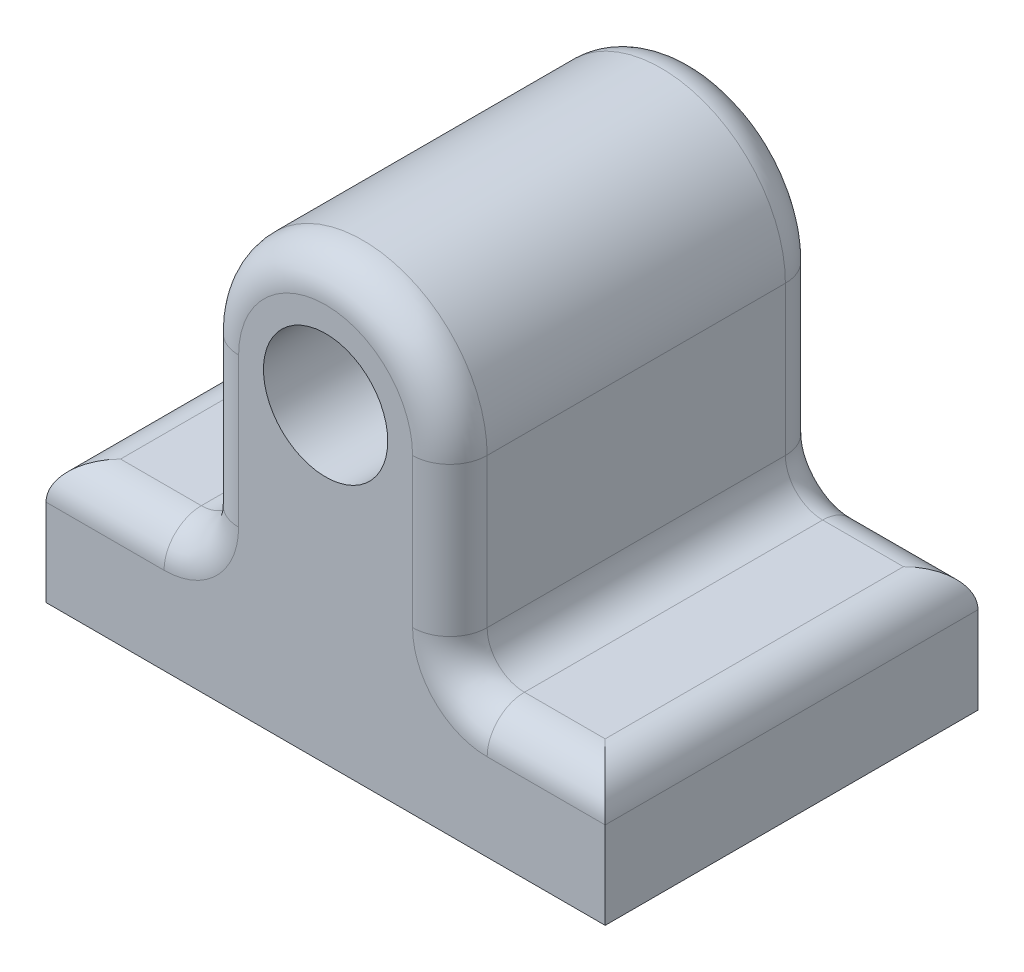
ISO-10303-21;
HEADER;
FILE_DESCRIPTION(('STEP AP214'),'2;1');
FILE_NAME('part.step','',(''),(''),'','','');
FILE_SCHEMA(('AUTOMOTIVE_DESIGN { 1 0 10303 214 1 1 1 1 }'));
ENDSEC;
DATA;
#1=APPLICATION_CONTEXT('core data for automotive mechanical design processes');
#2=APPLICATION_PROTOCOL_DEFINITION('international standard','automotive_design',2000,#1);
#3=PRODUCT_CONTEXT('',#1,'mechanical');
#4=PRODUCT('Part','Part','',(#3));
#5=PRODUCT_RELATED_PRODUCT_CATEGORY('part','',(#4));
#6=PRODUCT_DEFINITION_FORMATION('','',#4);
#7=PRODUCT_DEFINITION_CONTEXT('part definition',#1,'design');
#8=PRODUCT_DEFINITION('design','',#6,#7);
#9=PRODUCT_DEFINITION_SHAPE('','',#8);
#10=(LENGTH_UNIT() NAMED_UNIT(*) SI_UNIT(.MILLI.,.METRE.));
#11=(NAMED_UNIT(*) PLANE_ANGLE_UNIT() SI_UNIT($,.RADIAN.));
#12=(NAMED_UNIT(*) SI_UNIT($,.STERADIAN.) SOLID_ANGLE_UNIT());
#13=UNCERTAINTY_MEASURE_WITH_UNIT(LENGTH_MEASURE(1.E-05),#10,'distance_accuracy_value','');
#14=(GEOMETRIC_REPRESENTATION_CONTEXT(3) GLOBAL_UNCERTAINTY_ASSIGNED_CONTEXT((#13)) GLOBAL_UNIT_ASSIGNED_CONTEXT((#10,
#11,#12)) REPRESENTATION_CONTEXT('',''));
#15=CARTESIAN_POINT('',(0.,0.,0.));
#16=DIRECTION('',(0.,0.,1.));
#17=DIRECTION('',(1.,0.,0.));
#18=AXIS2_PLACEMENT_3D('',#15,#16,#17);
#19=CARTESIAN_POINT('',(80.,15.,30.));
#20=DIRECTION('',(0.,0.,1.));
#21=DIRECTION('',(1.,0.,0.));
#22=AXIS2_PLACEMENT_3D('',#19,#20,#21);
#23=PLANE('',#22);
#24=CARTESIAN_POINT('',(67.,3.,30.));
#25=DIRECTION('',(0.,0.,1.));
#26=DIRECTION('',(1.,0.,0.));
#27=AXIS2_PLACEMENT_3D('',#24,#25,#26);
#28=CIRCLE('',#27,6.);
#29=CARTESIAN_POINT('',(67.,-3.,30.));
#30=VERTEX_POINT('',#29);
#31=CARTESIAN_POINT('',(73.,3.,30.));
#32=VERTEX_POINT('',#31);
#33=EDGE_CURVE('E242',#30,#32,#28,.T.);
#34=ORIENTED_EDGE('',*,*,#33,.F.);
#35=DIRECTION('',(-1.,0.,0.));
#36=VECTOR('',#35,1.);
#37=CARTESIAN_POINT('',(57.5,-3.,30.));
#38=LINE('',#37,#36);
#39=CARTESIAN_POINT('',(57.5,-3.,30.));
#40=VERTEX_POINT('',#39);
#41=EDGE_CURVE('E166',#30,#40,#38,.T.);
#42=ORIENTED_EDGE('',*,*,#41,.T.);
#43=DIRECTION('',(0.,-1.,0.));
#44=VECTOR('',#43,1.);
#45=CARTESIAN_POINT('',(57.5,0.,30.));
#46=LINE('',#45,#44);
#47=CARTESIAN_POINT('',(57.5,-10.,30.));
#48=VERTEX_POINT('',#47);
#49=EDGE_CURVE('E158',#40,#48,#46,.T.);
#50=ORIENTED_EDGE('',*,*,#49,.T.);
#51=DIRECTION('',(1.,0.,0.));
#52=VECTOR('',#51,1.);
#53=CARTESIAN_POINT('',(57.5,-10.,30.));
#54=LINE('',#53,#52);
#55=CARTESIAN_POINT('',(102.5,-10.,30.));
#56=VERTEX_POINT('',#55);
#57=EDGE_CURVE('E163',#48,#56,#54,.T.);
#58=ORIENTED_EDGE('',*,*,#57,.T.);
#59=DIRECTION('',(0.,1.,0.));
#60=VECTOR('',#59,1.);
#61=CARTESIAN_POINT('',(102.5,-10.,30.));
#62=LINE('',#61,#60);
#63=CARTESIAN_POINT('',(102.5,-3.,30.));
#64=VERTEX_POINT('',#63);
#65=EDGE_CURVE('E184',#56,#64,#62,.T.);
#66=ORIENTED_EDGE('',*,*,#65,.T.);
#67=DIRECTION('',(-1.,0.,0.));
#68=VECTOR('',#67,1.);
#69=CARTESIAN_POINT('',(90.,-3.,30.));
#70=LINE('',#69,#68);
#71=CARTESIAN_POINT('',(93.,-3.,30.));
#72=VERTEX_POINT('',#71);
#73=EDGE_CURVE('E240',#64,#72,#70,.T.);
#74=ORIENTED_EDGE('',*,*,#73,.T.);
#75=CARTESIAN_POINT('',(93.,3.,30.));
#76=DIRECTION('',(0.,0.,1.));
#77=DIRECTION('',(1.,0.,0.));
#78=AXIS2_PLACEMENT_3D('',#75,#76,#77);
#79=CIRCLE('',#78,6.);
#80=CARTESIAN_POINT('',(87.,3.,30.));
#81=VERTEX_POINT('',#80);
#82=EDGE_CURVE('E237',#81,#72,#79,.T.);
#83=ORIENTED_EDGE('',*,*,#82,.F.);
#84=DIRECTION('',(0.,1.,0.));
#85=VECTOR('',#84,1.);
#86=CARTESIAN_POINT('',(87.,15.,30.));
#87=LINE('',#86,#85);
#88=CARTESIAN_POINT('',(87.,15.,30.));
#89=VERTEX_POINT('',#88);
#90=EDGE_CURVE('E235',#81,#89,#87,.T.);
#91=ORIENTED_EDGE('',*,*,#90,.T.);
#92=CARTESIAN_POINT('',(80.,15.,30.));
#93=DIRECTION('',(0.,0.,1.));
#94=DIRECTION('',(1.,0.,0.));
#95=AXIS2_PLACEMENT_3D('',#92,#93,#94);
#96=CIRCLE('',#95,6.99999999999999);
#97=CARTESIAN_POINT('',(73.,15.,30.));
#98=VERTEX_POINT('',#97);
#99=EDGE_CURVE('E231',#89,#98,#96,.T.);
#100=ORIENTED_EDGE('',*,*,#99,.T.);
#101=DIRECTION('',(0.,-1.,0.));
#102=VECTOR('',#101,1.);
#103=CARTESIAN_POINT('',(73.,0.,30.));
#104=LINE('',#103,#102);
#105=EDGE_CURVE('E233',#98,#32,#104,.T.);
#106=ORIENTED_EDGE('',*,*,#105,.T.);
#107=EDGE_LOOP('',(#34,#42,#50,#58,#66,#74,#83,#91,#100,#106));
#108=FACE_BOUND('',#107,.T.);
#109=CARTESIAN_POINT('',(80.,15.,30.));
#110=DIRECTION('',(0.,0.,1.));
#111=DIRECTION('',(1.,0.,0.));
#112=AXIS2_PLACEMENT_3D('',#109,#110,#111);
#113=CIRCLE('',#112,5.);
#114=CARTESIAN_POINT('',(85.,15.,30.));
#115=VERTEX_POINT('',#114);
#116=EDGE_CURVE('E192',#115,#115,#113,.T.);
#117=ORIENTED_EDGE('',*,*,#116,.F.);
#118=EDGE_LOOP('',(#117));
#119=FACE_BOUND('',#118,.T.);
#120=ADVANCED_FACE('F34',(#108,#119),#23,.T.);
#121=CARTESIAN_POINT('',(80.,15.,0.));
#122=DIRECTION('',(0.,0.,1.));
#123=DIRECTION('',(1.,0.,0.));
#124=AXIS2_PLACEMENT_3D('',#121,#122,#123);
#125=PLANE('',#124);
#126=CARTESIAN_POINT('',(93.,3.,0.));
#127=DIRECTION('',(0.,0.,1.));
#128=DIRECTION('',(1.,0.,0.));
#129=AXIS2_PLACEMENT_3D('',#126,#127,#128);
#130=CIRCLE('',#129,6.);
#131=CARTESIAN_POINT('',(93.,-3.,0.));
#132=VERTEX_POINT('',#131);
#133=CARTESIAN_POINT('',(87.,3.,0.));
#134=VERTEX_POINT('',#133);
#135=EDGE_CURVE('E220',#132,#134,#130,.F.);
#136=ORIENTED_EDGE('',*,*,#135,.F.);
#137=DIRECTION('',(-1.,0.,0.));
#138=VECTOR('',#137,1.);
#139=CARTESIAN_POINT('',(80.,-3.,0.));
#140=LINE('',#139,#138);
#141=CARTESIAN_POINT('',(102.5,-3.,0.));
#142=VERTEX_POINT('',#141);
#143=EDGE_CURVE('E223',#132,#142,#140,.F.);
#144=ORIENTED_EDGE('',*,*,#143,.T.);
#145=DIRECTION('',(0.,1.,0.));
#146=VECTOR('',#145,1.);
#147=CARTESIAN_POINT('',(102.5,-10.,0.));
#148=LINE('',#147,#146);
#149=CARTESIAN_POINT('',(102.5,-10.,0.));
#150=VERTEX_POINT('',#149);
#151=EDGE_CURVE('E169',#150,#142,#148,.T.);
#152=ORIENTED_EDGE('',*,*,#151,.F.);
#153=DIRECTION('',(1.,0.,0.));
#154=VECTOR('',#153,1.);
#155=CARTESIAN_POINT('',(57.5,-10.,0.));
#156=LINE('',#155,#154);
#157=CARTESIAN_POINT('',(57.5,-10.,0.));
#158=VERTEX_POINT('',#157);
#159=EDGE_CURVE('E191',#158,#150,#156,.T.);
#160=ORIENTED_EDGE('',*,*,#159,.F.);
#161=DIRECTION('',(0.,-1.,0.));
#162=VECTOR('',#161,1.);
#163=CARTESIAN_POINT('',(57.5,0.,0.));
#164=LINE('',#163,#162);
#165=CARTESIAN_POINT('',(57.5,-3.,0.));
#166=VERTEX_POINT('',#165);
#167=EDGE_CURVE('E175',#166,#158,#164,.T.);
#168=ORIENTED_EDGE('',*,*,#167,.F.);
#169=DIRECTION('',(-1.,0.,0.));
#170=VECTOR('',#169,1.);
#171=CARTESIAN_POINT('',(80.,-3.,0.));
#172=LINE('',#171,#170);
#173=CARTESIAN_POINT('',(67.,-3.,0.));
#174=VERTEX_POINT('',#173);
#175=EDGE_CURVE('E218',#166,#174,#172,.F.);
#176=ORIENTED_EDGE('',*,*,#175,.T.);
#177=CARTESIAN_POINT('',(67.,3.,0.));
#178=DIRECTION('',(0.,0.,1.));
#179=DIRECTION('',(1.,0.,0.));
#180=AXIS2_PLACEMENT_3D('',#177,#178,#179);
#181=CIRCLE('',#180,6.);
#182=CARTESIAN_POINT('',(73.,3.,0.));
#183=VERTEX_POINT('',#182);
#184=EDGE_CURVE('E215',#183,#174,#181,.F.);
#185=ORIENTED_EDGE('',*,*,#184,.F.);
#186=DIRECTION('',(0.,-1.,0.));
#187=VECTOR('',#186,1.);
#188=CARTESIAN_POINT('',(73.,15.,0.));
#189=LINE('',#188,#187);
#190=CARTESIAN_POINT('',(73.,15.,0.));
#191=VERTEX_POINT('',#190);
#192=EDGE_CURVE('E210',#183,#191,#189,.F.);
#193=ORIENTED_EDGE('',*,*,#192,.T.);
#194=CARTESIAN_POINT('',(80.,15.,0.));
#195=DIRECTION('',(0.,0.,1.));
#196=DIRECTION('',(1.,0.,0.));
#197=AXIS2_PLACEMENT_3D('',#194,#195,#196);
#198=CIRCLE('',#197,6.99999999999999);
#199=CARTESIAN_POINT('',(87.,15.,0.));
#200=VERTEX_POINT('',#199);
#201=EDGE_CURVE('E208',#191,#200,#198,.F.);
#202=ORIENTED_EDGE('',*,*,#201,.T.);
#203=DIRECTION('',(0.,1.,0.));
#204=VECTOR('',#203,1.);
#205=CARTESIAN_POINT('',(87.,15.,0.));
#206=LINE('',#205,#204);
#207=EDGE_CURVE('E212',#200,#134,#206,.F.);
#208=ORIENTED_EDGE('',*,*,#207,.T.);
#209=EDGE_LOOP('',(#136,#144,#152,#160,#168,#176,#185,#193,#202,#208));
#210=FACE_BOUND('',#209,.T.);
#211=CARTESIAN_POINT('',(80.,15.,0.));
#212=DIRECTION('',(0.,0.,1.));
#213=DIRECTION('',(1.,0.,0.));
#214=AXIS2_PLACEMENT_3D('',#211,#212,#213);
#215=CIRCLE('',#214,5.);
#216=CARTESIAN_POINT('',(85.,15.,0.));
#217=VERTEX_POINT('',#216);
#218=EDGE_CURVE('E322',#217,#217,#215,.T.);
#219=ORIENTED_EDGE('',*,*,#218,.T.);
#220=EDGE_LOOP('',(#219));
#221=FACE_BOUND('',#220,.T.);
#222=ADVANCED_FACE('F337',(#210,#221),#125,.F.);
#223=CARTESIAN_POINT('',(80.,15.,30.));
#224=DIRECTION('',(0.,0.,-1.));
#225=DIRECTION('',(-1.,0.,0.));
#226=AXIS2_PLACEMENT_3D('',#223,#224,#225);
#227=CYLINDRICAL_SURFACE('',#226,9.99999999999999);
#228=DIRECTION('',(0.,0.,-1.));
#229=VECTOR('',#228,1.);
#230=CARTESIAN_POINT('',(90.,15.,30.));
#231=LINE('',#230,#229);
#232=CARTESIAN_POINT('',(90.,15.,27.));
#233=VERTEX_POINT('',#232);
#234=CARTESIAN_POINT('',(90.,15.,3.));
#235=VERTEX_POINT('',#234);
#236=EDGE_CURVE('E186',#233,#235,#231,.T.);
#237=ORIENTED_EDGE('',*,*,#236,.T.);
#238=CARTESIAN_POINT('',(80.,15.,3.));
#239=DIRECTION('',(0.,0.,1.));
#240=DIRECTION('',(1.,0.,0.));
#241=AXIS2_PLACEMENT_3D('',#238,#239,#240);
#242=CIRCLE('',#241,9.99999999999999);
#243=CARTESIAN_POINT('',(70.,15.,3.));
#244=VERTEX_POINT('',#243);
#245=EDGE_CURVE('E11',#235,#244,#242,.T.);
#246=ORIENTED_EDGE('',*,*,#245,.T.);
#247=DIRECTION('',(0.,0.,-1.));
#248=VECTOR('',#247,1.);
#249=CARTESIAN_POINT('',(70.,15.,30.));
#250=LINE('',#249,#248);
#251=CARTESIAN_POINT('',(70.,15.,27.));
#252=VERTEX_POINT('',#251);
#253=EDGE_CURVE('E178',#252,#244,#250,.T.);
#254=ORIENTED_EDGE('',*,*,#253,.F.);
#255=CARTESIAN_POINT('',(80.,15.,27.));
#256=DIRECTION('',(0.,0.,1.));
#257=DIRECTION('',(1.,0.,0.));
#258=AXIS2_PLACEMENT_3D('',#255,#256,#257);
#259=CIRCLE('',#258,9.99999999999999);
#260=EDGE_CURVE('E43',#252,#233,#259,.F.);
#261=ORIENTED_EDGE('',*,*,#260,.T.);
#262=EDGE_LOOP('',(#237,#246,#254,#261));
#263=FACE_BOUND('',#262,.T.);
#264=ADVANCED_FACE('F342',(#263),#227,.T.);
#265=CARTESIAN_POINT('',(70.,15.,30.));
#266=DIRECTION('',(1.,0.,0.));
#267=DIRECTION('',(0.,0.,-1.));
#268=AXIS2_PLACEMENT_3D('',#265,#266,#267);
#269=PLANE('',#268);
#270=ORIENTED_EDGE('',*,*,#253,.T.);
#271=DIRECTION('',(0.,-1.,0.));
#272=VECTOR('',#271,1.);
#273=CARTESIAN_POINT('',(70.,15.,3.));
#274=LINE('',#273,#272);
#275=CARTESIAN_POINT('',(70.,3.,3.));
#276=VERTEX_POINT('',#275);
#277=EDGE_CURVE('E229',#244,#276,#274,.T.);
#278=ORIENTED_EDGE('',*,*,#277,.T.);
#279=DIRECTION('',(0.,0.,-1.));
#280=VECTOR('',#279,1.);
#281=CARTESIAN_POINT('',(70.,3.,30.));
#282=LINE('',#281,#280);
#283=CARTESIAN_POINT('',(70.,3.,27.));
#284=VERTEX_POINT('',#283);
#285=EDGE_CURVE('E225',#276,#284,#282,.F.);
#286=ORIENTED_EDGE('',*,*,#285,.T.);
#287=DIRECTION('',(0.,-1.,0.));
#288=VECTOR('',#287,1.);
#289=CARTESIAN_POINT('',(70.,15.,27.));
#290=LINE('',#289,#288);
#291=EDGE_CURVE('E227',#284,#252,#290,.F.);
#292=ORIENTED_EDGE('',*,*,#291,.T.);
#293=EDGE_LOOP('',(#270,#278,#286,#292));
#294=FACE_BOUND('',#293,.T.);
#295=ADVANCED_FACE('F365',(#294),#269,.F.);
#296=CARTESIAN_POINT('',(70.,0.,30.));
#297=DIRECTION('',(0.,-1.,0.));
#298=DIRECTION('',(0.,0.,-1.));
#299=AXIS2_PLACEMENT_3D('',#296,#297,#298);
#300=PLANE('',#299);
#301=DIRECTION('',(0.,0.,-1.));
#302=VECTOR('',#301,1.);
#303=CARTESIAN_POINT('',(67.,0.,0.));
#304=LINE('',#303,#302);
#305=CARTESIAN_POINT('',(67.,0.,27.));
#306=VERTEX_POINT('',#305);
#307=CARTESIAN_POINT('',(67.,0.,3.));
#308=VERTEX_POINT('',#307);
#309=EDGE_CURVE('E250',#306,#308,#304,.T.);
#310=ORIENTED_EDGE('',*,*,#309,.T.);
#311=DIRECTION('',(-1.,0.,0.));
#312=VECTOR('',#311,1.);
#313=CARTESIAN_POINT('',(70.,0.,3.));
#314=LINE('',#313,#312);
#315=CARTESIAN_POINT('',(60.5,0.,3.));
#316=VERTEX_POINT('',#315);
#317=EDGE_CURVE('E253',#308,#316,#314,.T.);
#318=ORIENTED_EDGE('',*,*,#317,.T.);
#319=DIRECTION('',(0.,0.,-1.));
#320=VECTOR('',#319,1.);
#321=CARTESIAN_POINT('',(60.5,0.,30.));
#322=LINE('',#321,#320);
#323=CARTESIAN_POINT('',(60.5,0.,27.));
#324=VERTEX_POINT('',#323);
#325=EDGE_CURVE('E248',#316,#324,#322,.F.);
#326=ORIENTED_EDGE('',*,*,#325,.T.);
#327=DIRECTION('',(-1.,0.,0.));
#328=VECTOR('',#327,1.);
#329=CARTESIAN_POINT('',(70.,0.,27.));
#330=LINE('',#329,#328);
#331=EDGE_CURVE('E246',#324,#306,#330,.F.);
#332=ORIENTED_EDGE('',*,*,#331,.T.);
#333=EDGE_LOOP('',(#310,#318,#326,#332));
#334=FACE_BOUND('',#333,.T.);
#335=ADVANCED_FACE('F362',(#334),#300,.F.);
#336=CARTESIAN_POINT('',(57.5,0.,30.));
#337=DIRECTION('',(1.,0.,0.));
#338=DIRECTION('',(0.,0.,-1.));
#339=AXIS2_PLACEMENT_3D('',#336,#337,#338);
#340=PLANE('',#339);
#341=ORIENTED_EDGE('',*,*,#49,.F.);
#342=DIRECTION('',(0.,0.,-1.));
#343=VECTOR('',#342,1.);
#344=CARTESIAN_POINT('',(57.5,-3.,30.));
#345=LINE('',#344,#343);
#346=EDGE_CURVE('E255',#40,#166,#345,.T.);
#347=ORIENTED_EDGE('',*,*,#346,.T.);
#348=ORIENTED_EDGE('',*,*,#167,.T.);
#349=DIRECTION('',(0.,0.,-1.));
#350=VECTOR('',#349,1.);
#351=CARTESIAN_POINT('',(57.5,-10.,30.));
#352=LINE('',#351,#350);
#353=EDGE_CURVE('E172',#48,#158,#352,.T.);
#354=ORIENTED_EDGE('',*,*,#353,.F.);
#355=EDGE_LOOP('',(#341,#347,#348,#354));
#356=FACE_BOUND('',#355,.T.);
#357=ADVANCED_FACE('F173',(#356),#340,.F.);
#358=CARTESIAN_POINT('',(57.5,-10.,30.));
#359=DIRECTION('',(0.,1.,0.));
#360=DIRECTION('',(0.,0.,1.));
#361=AXIS2_PLACEMENT_3D('',#358,#359,#360);
#362=PLANE('',#361);
#363=ORIENTED_EDGE('',*,*,#159,.T.);
#364=DIRECTION('',(0.,0.,-1.));
#365=VECTOR('',#364,1.);
#366=CARTESIAN_POINT('',(102.5,-10.,30.));
#367=LINE('',#366,#365);
#368=EDGE_CURVE('E179',#56,#150,#367,.T.);
#369=ORIENTED_EDGE('',*,*,#368,.F.);
#370=ORIENTED_EDGE('',*,*,#57,.F.);
#371=ORIENTED_EDGE('',*,*,#353,.T.);
#372=EDGE_LOOP('',(#363,#369,#370,#371));
#373=FACE_BOUND('',#372,.T.);
#374=ADVANCED_FACE('F181',(#373),#362,.F.);
#375=CARTESIAN_POINT('',(102.5,-10.,30.));
#376=DIRECTION('',(-1.,0.,0.));
#377=DIRECTION('',(0.,0.,1.));
#378=AXIS2_PLACEMENT_3D('',#375,#376,#377);
#379=PLANE('',#378);
#380=ORIENTED_EDGE('',*,*,#151,.T.);
#381=DIRECTION('',(0.,0.,-1.));
#382=VECTOR('',#381,1.);
#383=CARTESIAN_POINT('',(102.5,-3.,30.));
#384=LINE('',#383,#382);
#385=EDGE_CURVE('E263',#142,#64,#384,.F.);
#386=ORIENTED_EDGE('',*,*,#385,.T.);
#387=ORIENTED_EDGE('',*,*,#65,.F.);
#388=ORIENTED_EDGE('',*,*,#368,.T.);
#389=EDGE_LOOP('',(#380,#386,#387,#388));
#390=FACE_BOUND('',#389,.T.);
#391=ADVANCED_FACE('F354',(#390),#379,.F.);
#392=CARTESIAN_POINT('',(102.5,0.,30.));
#393=DIRECTION('',(0.,-1.,0.));
#394=DIRECTION('',(0.,0.,-1.));
#395=AXIS2_PLACEMENT_3D('',#392,#393,#394);
#396=PLANE('',#395);
#397=DIRECTION('',(0.,0.,-1.));
#398=VECTOR('',#397,1.);
#399=CARTESIAN_POINT('',(93.,0.,30.));
#400=LINE('',#399,#398);
#401=CARTESIAN_POINT('',(93.,0.,3.));
#402=VERTEX_POINT('',#401);
#403=CARTESIAN_POINT('',(93.,0.,27.));
#404=VERTEX_POINT('',#403);
#405=EDGE_CURVE('E56',#402,#404,#400,.F.);
#406=ORIENTED_EDGE('',*,*,#405,.T.);
#407=DIRECTION('',(-1.,0.,0.));
#408=VECTOR('',#407,1.);
#409=CARTESIAN_POINT('',(102.5,0.,27.));
#410=LINE('',#409,#408);
#411=CARTESIAN_POINT('',(99.5,0.,27.));
#412=VERTEX_POINT('',#411);
#413=EDGE_CURVE('E51',#404,#412,#410,.F.);
#414=ORIENTED_EDGE('',*,*,#413,.T.);
#415=DIRECTION('',(0.,0.,-1.));
#416=VECTOR('',#415,1.);
#417=CARTESIAN_POINT('',(99.5,0.,30.));
#418=LINE('',#417,#416);
#419=CARTESIAN_POINT('',(99.5,0.,3.));
#420=VERTEX_POINT('',#419);
#421=EDGE_CURVE('E260',#412,#420,#418,.T.);
#422=ORIENTED_EDGE('',*,*,#421,.T.);
#423=DIRECTION('',(-1.,0.,0.));
#424=VECTOR('',#423,1.);
#425=CARTESIAN_POINT('',(102.5,0.,3.));
#426=LINE('',#425,#424);
#427=EDGE_CURVE('E257',#420,#402,#426,.T.);
#428=ORIENTED_EDGE('',*,*,#427,.T.);
#429=EDGE_LOOP('',(#406,#414,#422,#428));
#430=FACE_BOUND('',#429,.T.);
#431=ADVANCED_FACE('F350',(#430),#396,.F.);
#432=CARTESIAN_POINT('',(90.,0.,30.));
#433=DIRECTION('',(-1.,0.,0.));
#434=DIRECTION('',(0.,0.,1.));
#435=AXIS2_PLACEMENT_3D('',#432,#433,#434);
#436=PLANE('',#435);
#437=DIRECTION('',(0.,0.,-1.));
#438=VECTOR('',#437,1.);
#439=CARTESIAN_POINT('',(90.,3.,0.));
#440=LINE('',#439,#438);
#441=CARTESIAN_POINT('',(90.,3.,27.));
#442=VERTEX_POINT('',#441);
#443=CARTESIAN_POINT('',(90.,3.,3.));
#444=VERTEX_POINT('',#443);
#445=EDGE_CURVE('E201',#442,#444,#440,.T.);
#446=ORIENTED_EDGE('',*,*,#445,.T.);
#447=DIRECTION('',(0.,1.,0.));
#448=VECTOR('',#447,1.);
#449=CARTESIAN_POINT('',(90.,0.,3.));
#450=LINE('',#449,#448);
#451=EDGE_CURVE('E205',#444,#235,#450,.T.);
#452=ORIENTED_EDGE('',*,*,#451,.T.);
#453=ORIENTED_EDGE('',*,*,#236,.F.);
#454=DIRECTION('',(0.,1.,0.));
#455=VECTOR('',#454,1.);
#456=CARTESIAN_POINT('',(90.,0.,27.));
#457=LINE('',#456,#455);
#458=EDGE_CURVE('E203',#233,#442,#457,.F.);
#459=ORIENTED_EDGE('',*,*,#458,.T.);
#460=EDGE_LOOP('',(#446,#452,#453,#459));
#461=FACE_BOUND('',#460,.T.);
#462=ADVANCED_FACE('F347',(#461),#436,.F.);
#463=CARTESIAN_POINT('',(80.,15.,30.));
#464=DIRECTION('',(0.,0.,-1.));
#465=DIRECTION('',(-1.,0.,0.));
#466=AXIS2_PLACEMENT_3D('',#463,#464,#465);
#467=CYLINDRICAL_SURFACE('',#466,5.);
#468=ORIENTED_EDGE('',*,*,#116,.T.);
#469=EDGE_LOOP('',(#468));
#470=FACE_BOUND('',#469,.T.);
#471=ORIENTED_EDGE('',*,*,#218,.F.);
#472=EDGE_LOOP('',(#471));
#473=FACE_BOUND('',#472,.T.);
#474=ADVANCED_FACE('F334',(#470,#473),#467,.F.);
#475=CARTESIAN_POINT('',(73.,15.,27.));
#476=DIRECTION('',(0.,1.,0.));
#477=DIRECTION('',(0.,0.,1.));
#478=AXIS2_PLACEMENT_3D('',#475,#476,#477);
#479=CYLINDRICAL_SURFACE('',#478,3.);
#480=CARTESIAN_POINT('',(73.,3.,27.));
#481=DIRECTION('',(0.,-1.,0.));
#482=DIRECTION('',(0.,0.,-1.));
#483=AXIS2_PLACEMENT_3D('',#480,#481,#482);
#484=CIRCLE('',#483,3.);
#485=EDGE_CURVE('E316',#32,#284,#484,.T.);
#486=ORIENTED_EDGE('',*,*,#485,.F.);
#487=ORIENTED_EDGE('',*,*,#105,.F.);
#488=CARTESIAN_POINT('',(73.,15.,27.));
#489=DIRECTION('',(0.,1.,0.));
#490=DIRECTION('',(0.,0.,1.));
#491=AXIS2_PLACEMENT_3D('',#488,#489,#490);
#492=CIRCLE('',#491,3.);
#493=EDGE_CURVE('E38',#252,#98,#492,.T.);
#494=ORIENTED_EDGE('',*,*,#493,.F.);
#495=ORIENTED_EDGE('',*,*,#291,.F.);
#496=EDGE_LOOP('',(#486,#487,#494,#495));
#497=FACE_BOUND('',#496,.T.);
#498=ADVANCED_FACE('F36',(#497),#479,.T.);
#499=CARTESIAN_POINT('',(80.,-3.,27.));
#500=DIRECTION('',(1.,0.,0.));
#501=DIRECTION('',(0.,0.,-1.));
#502=AXIS2_PLACEMENT_3D('',#499,#500,#501);
#503=CYLINDRICAL_SURFACE('',#502,3.);
#504=CARTESIAN_POINT('',(60.5,-3.,27.));
#505=DIRECTION('',(0.707106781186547,0.,0.707106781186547));
#506=DIRECTION('',(0.707106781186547,0.,-0.707106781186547));
#507=AXIS2_PLACEMENT_3D('',#504,#505,#506);
#508=ELLIPSE('',#507,4.24264068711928,3.);
#509=EDGE_CURVE('E311',#40,#324,#508,.F.);
#510=ORIENTED_EDGE('',*,*,#509,.F.);
#511=ORIENTED_EDGE('',*,*,#41,.F.);
#512=CARTESIAN_POINT('',(67.,-3.,27.));
#513=DIRECTION('',(1.,0.,0.));
#514=DIRECTION('',(0.,0.,-1.));
#515=AXIS2_PLACEMENT_3D('',#512,#513,#514);
#516=CIRCLE('',#515,3.);
#517=EDGE_CURVE('E314',#306,#30,#516,.T.);
#518=ORIENTED_EDGE('',*,*,#517,.F.);
#519=ORIENTED_EDGE('',*,*,#331,.F.);
#520=EDGE_LOOP('',(#510,#511,#518,#519));
#521=FACE_BOUND('',#520,.T.);
#522=ADVANCED_FACE('F434',(#521),#503,.T.);
#523=CARTESIAN_POINT('',(80.,15.,27.));
#524=DIRECTION('',(0.,0.,1.));
#525=DIRECTION('',(1.,0.,0.));
#526=AXIS2_PLACEMENT_3D('',#523,#524,#525);
#527=TOROIDAL_SURFACE('',#526,6.99999999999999,3.);
#528=ORIENTED_EDGE('',*,*,#493,.T.);
#529=ORIENTED_EDGE('',*,*,#99,.F.);
#530=CARTESIAN_POINT('',(87.,15.,27.));
#531=DIRECTION('',(0.,-1.,0.));
#532=DIRECTION('',(0.,0.,-1.));
#533=AXIS2_PLACEMENT_3D('',#530,#531,#532);
#534=CIRCLE('',#533,3.);
#535=EDGE_CURVE('E308',#233,#89,#534,.T.);
#536=ORIENTED_EDGE('',*,*,#535,.F.);
#537=ORIENTED_EDGE('',*,*,#260,.F.);
#538=EDGE_LOOP('',(#528,#529,#536,#537));
#539=FACE_BOUND('',#538,.T.);
#540=ADVANCED_FACE('F432',(#539),#527,.T.);
#541=CARTESIAN_POINT('',(67.,3.,27.));
#542=DIRECTION('',(0.,0.,1.));
#543=DIRECTION('',(1.,0.,0.));
#544=AXIS2_PLACEMENT_3D('',#541,#542,#543);
#545=TOROIDAL_SURFACE('',#544,6.,3.);
#546=ORIENTED_EDGE('',*,*,#33,.T.);
#547=ORIENTED_EDGE('',*,*,#485,.T.);
#548=CARTESIAN_POINT('',(67.,3.,27.));
#549=DIRECTION('',(0.,0.,1.));
#550=DIRECTION('',(1.,0.,0.));
#551=AXIS2_PLACEMENT_3D('',#548,#549,#550);
#552=CIRCLE('',#551,3.);
#553=EDGE_CURVE('E305',#306,#284,#552,.T.);
#554=ORIENTED_EDGE('',*,*,#553,.F.);
#555=ORIENTED_EDGE('',*,*,#517,.T.);
#556=EDGE_LOOP('',(#546,#547,#554,#555));
#557=FACE_BOUND('',#556,.T.);
#558=ADVANCED_FACE('F428',(#557),#545,.T.);
#559=CARTESIAN_POINT('',(60.5,-3.,30.));
#560=DIRECTION('',(0.,0.,-1.));
#561=DIRECTION('',(-1.,0.,0.));
#562=AXIS2_PLACEMENT_3D('',#559,#560,#561);
#563=CYLINDRICAL_SURFACE('',#562,3.);
#564=ORIENTED_EDGE('',*,*,#509,.T.);
#565=ORIENTED_EDGE('',*,*,#325,.F.);
#566=CARTESIAN_POINT('',(60.5,-3.,3.));
#567=DIRECTION('',(-0.707106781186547,0.,0.707106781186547));
#568=DIRECTION('',(-0.707106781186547,0.,-0.707106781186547));
#569=AXIS2_PLACEMENT_3D('',#566,#567,#568);
#570=ELLIPSE('',#569,4.24264068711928,3.);
#571=EDGE_CURVE('E302',#166,#316,#570,.F.);
#572=ORIENTED_EDGE('',*,*,#571,.F.);
#573=ORIENTED_EDGE('',*,*,#346,.F.);
#574=EDGE_LOOP('',(#564,#565,#572,#573));
#575=FACE_BOUND('',#574,.T.);
#576=ADVANCED_FACE('F424',(#575),#563,.T.);
#577=CARTESIAN_POINT('',(80.,-3.,27.));
#578=DIRECTION('',(1.,0.,0.));
#579=DIRECTION('',(0.,0.,-1.));
#580=AXIS2_PLACEMENT_3D('',#577,#578,#579);
#581=CYLINDRICAL_SURFACE('',#580,3.);
#582=CARTESIAN_POINT('',(93.,-3.,27.));
#583=DIRECTION('',(-1.,0.,0.));
#584=DIRECTION('',(0.,0.,1.));
#585=AXIS2_PLACEMENT_3D('',#582,#583,#584);
#586=CIRCLE('',#585,3.);
#587=EDGE_CURVE('E296',#72,#404,#586,.T.);
#588=ORIENTED_EDGE('',*,*,#587,.F.);
#589=ORIENTED_EDGE('',*,*,#73,.F.);
#590=CARTESIAN_POINT('',(99.5,-3.,27.));
#591=DIRECTION('',(0.707106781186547,0.,-0.707106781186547));
#592=DIRECTION('',(0.707106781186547,0.,0.707106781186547));
#593=AXIS2_PLACEMENT_3D('',#590,#591,#592);
#594=ELLIPSE('',#593,4.24264068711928,3.);
#595=EDGE_CURVE('E299',#412,#64,#594,.T.);
#596=ORIENTED_EDGE('',*,*,#595,.F.);
#597=ORIENTED_EDGE('',*,*,#413,.F.);
#598=EDGE_LOOP('',(#588,#589,#596,#597));
#599=FACE_BOUND('',#598,.T.);
#600=ADVANCED_FACE('F420',(#599),#581,.T.);
#601=CARTESIAN_POINT('',(87.,15.,27.));
#602=DIRECTION('',(0.,-1.,0.));
#603=DIRECTION('',(0.,0.,-1.));
#604=AXIS2_PLACEMENT_3D('',#601,#602,#603);
#605=CYLINDRICAL_SURFACE('',#604,3.);
#606=ORIENTED_EDGE('',*,*,#535,.T.);
#607=ORIENTED_EDGE('',*,*,#90,.F.);
#608=CARTESIAN_POINT('',(87.,3.,27.));
#609=DIRECTION('',(0.,-1.,0.));
#610=DIRECTION('',(0.,0.,-1.));
#611=AXIS2_PLACEMENT_3D('',#608,#609,#610);
#612=CIRCLE('',#611,3.);
#613=EDGE_CURVE('E293',#442,#81,#612,.T.);
#614=ORIENTED_EDGE('',*,*,#613,.F.);
#615=ORIENTED_EDGE('',*,*,#458,.F.);
#616=EDGE_LOOP('',(#606,#607,#614,#615));
#617=FACE_BOUND('',#616,.T.);
#618=ADVANCED_FACE('F416',(#617),#605,.T.);
#619=CARTESIAN_POINT('',(67.,3.,30.));
#620=DIRECTION('',(0.,0.,1.));
#621=DIRECTION('',(1.,0.,0.));
#622=AXIS2_PLACEMENT_3D('',#619,#620,#621);
#623=CYLINDRICAL_SURFACE('',#622,3.);
#624=ORIENTED_EDGE('',*,*,#553,.T.);
#625=ORIENTED_EDGE('',*,*,#285,.F.);
#626=CARTESIAN_POINT('',(67.,3.,3.));
#627=DIRECTION('',(0.,0.,1.));
#628=DIRECTION('',(1.,0.,0.));
#629=AXIS2_PLACEMENT_3D('',#626,#627,#628);
#630=CIRCLE('',#629,3.);
#631=EDGE_CURVE('E290',#308,#276,#630,.T.);
#632=ORIENTED_EDGE('',*,*,#631,.F.);
#633=ORIENTED_EDGE('',*,*,#309,.F.);
#634=EDGE_LOOP('',(#624,#625,#632,#633));
#635=FACE_BOUND('',#634,.T.);
#636=ADVANCED_FACE('F412',(#635),#623,.F.);
#637=CARTESIAN_POINT('',(70.,-3.,3.));
#638=DIRECTION('',(-1.,0.,0.));
#639=DIRECTION('',(0.,0.,1.));
#640=AXIS2_PLACEMENT_3D('',#637,#638,#639);
#641=CYLINDRICAL_SURFACE('',#640,3.);
#642=ORIENTED_EDGE('',*,*,#571,.T.);
#643=ORIENTED_EDGE('',*,*,#317,.F.);
#644=CARTESIAN_POINT('',(67.,-3.,3.));
#645=DIRECTION('',(1.,0.,0.));
#646=DIRECTION('',(0.,0.,-1.));
#647=AXIS2_PLACEMENT_3D('',#644,#645,#646);
#648=CIRCLE('',#647,3.);
#649=EDGE_CURVE('E288',#174,#308,#648,.T.);
#650=ORIENTED_EDGE('',*,*,#649,.F.);
#651=ORIENTED_EDGE('',*,*,#175,.F.);
#652=EDGE_LOOP('',(#642,#643,#650,#651));
#653=FACE_BOUND('',#652,.T.);
#654=ADVANCED_FACE('F408',(#653),#641,.T.);
#655=CARTESIAN_POINT('',(99.5,-3.,30.));
#656=DIRECTION('',(0.,0.,-1.));
#657=DIRECTION('',(-1.,0.,0.));
#658=AXIS2_PLACEMENT_3D('',#655,#656,#657);
#659=CYLINDRICAL_SURFACE('',#658,3.);
#660=ORIENTED_EDGE('',*,*,#595,.T.);
#661=ORIENTED_EDGE('',*,*,#385,.F.);
#662=CARTESIAN_POINT('',(99.5,-3.,3.));
#663=DIRECTION('',(-0.707106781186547,0.,-0.707106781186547));
#664=DIRECTION('',(-0.707106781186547,0.,0.707106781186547));
#665=AXIS2_PLACEMENT_3D('',#662,#663,#664);
#666=ELLIPSE('',#665,4.24264068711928,3.);
#667=EDGE_CURVE('E285',#420,#142,#666,.T.);
#668=ORIENTED_EDGE('',*,*,#667,.F.);
#669=ORIENTED_EDGE('',*,*,#421,.F.);
#670=EDGE_LOOP('',(#660,#661,#668,#669));
#671=FACE_BOUND('',#670,.T.);
#672=ADVANCED_FACE('F404',(#671),#659,.T.);
#673=CARTESIAN_POINT('',(93.,3.,27.));
#674=DIRECTION('',(0.,0.,1.));
#675=DIRECTION('',(1.,0.,0.));
#676=AXIS2_PLACEMENT_3D('',#673,#674,#675);
#677=TOROIDAL_SURFACE('',#676,6.,3.);
#678=ORIENTED_EDGE('',*,*,#82,.T.);
#679=ORIENTED_EDGE('',*,*,#587,.T.);
#680=CARTESIAN_POINT('',(93.,3.,27.));
#681=DIRECTION('',(0.,0.,1.));
#682=DIRECTION('',(1.,0.,0.));
#683=AXIS2_PLACEMENT_3D('',#680,#681,#682);
#684=CIRCLE('',#683,3.);
#685=EDGE_CURVE('E282',#442,#404,#684,.T.);
#686=ORIENTED_EDGE('',*,*,#685,.F.);
#687=ORIENTED_EDGE('',*,*,#613,.T.);
#688=EDGE_LOOP('',(#678,#679,#686,#687));
#689=FACE_BOUND('',#688,.T.);
#690=ADVANCED_FACE('F400',(#689),#677,.T.);
#691=CARTESIAN_POINT('',(67.,3.,3.));
#692=DIRECTION('',(0.,0.,1.));
#693=DIRECTION('',(1.,0.,0.));
#694=AXIS2_PLACEMENT_3D('',#691,#692,#693);
#695=TOROIDAL_SURFACE('',#694,6.,3.);
#696=ORIENTED_EDGE('',*,*,#649,.T.);
#697=ORIENTED_EDGE('',*,*,#631,.T.);
#698=CARTESIAN_POINT('',(73.,3.,3.));
#699=DIRECTION('',(0.,-1.,0.));
#700=DIRECTION('',(0.,0.,-1.));
#701=AXIS2_PLACEMENT_3D('',#698,#699,#700);
#702=CIRCLE('',#701,3.);
#703=EDGE_CURVE('E279',#183,#276,#702,.F.);
#704=ORIENTED_EDGE('',*,*,#703,.F.);
#705=ORIENTED_EDGE('',*,*,#184,.T.);
#706=EDGE_LOOP('',(#696,#697,#704,#705));
#707=FACE_BOUND('',#706,.T.);
#708=ADVANCED_FACE('F396',(#707),#695,.T.);
#709=CARTESIAN_POINT('',(102.5,-3.,3.));
#710=DIRECTION('',(-1.,0.,0.));
#711=DIRECTION('',(0.,0.,1.));
#712=AXIS2_PLACEMENT_3D('',#709,#710,#711);
#713=CYLINDRICAL_SURFACE('',#712,3.);
#714=ORIENTED_EDGE('',*,*,#667,.T.);
#715=ORIENTED_EDGE('',*,*,#143,.F.);
#716=CARTESIAN_POINT('',(93.,-3.,3.));
#717=DIRECTION('',(-1.,0.,0.));
#718=DIRECTION('',(0.,0.,1.));
#719=AXIS2_PLACEMENT_3D('',#716,#717,#718);
#720=CIRCLE('',#719,3.);
#721=EDGE_CURVE('E276',#402,#132,#720,.T.);
#722=ORIENTED_EDGE('',*,*,#721,.F.);
#723=ORIENTED_EDGE('',*,*,#427,.F.);
#724=EDGE_LOOP('',(#714,#715,#722,#723));
#725=FACE_BOUND('',#724,.T.);
#726=ADVANCED_FACE('F392',(#725),#713,.T.);
#727=CARTESIAN_POINT('',(93.,3.,30.));
#728=DIRECTION('',(0.,0.,1.));
#729=DIRECTION('',(1.,0.,0.));
#730=AXIS2_PLACEMENT_3D('',#727,#728,#729);
#731=CYLINDRICAL_SURFACE('',#730,3.);
#732=ORIENTED_EDGE('',*,*,#685,.T.);
#733=ORIENTED_EDGE('',*,*,#405,.F.);
#734=CARTESIAN_POINT('',(93.,3.,3.));
#735=DIRECTION('',(0.,0.,1.));
#736=DIRECTION('',(1.,0.,0.));
#737=AXIS2_PLACEMENT_3D('',#734,#735,#736);
#738=CIRCLE('',#737,3.);
#739=EDGE_CURVE('E273',#444,#402,#738,.T.);
#740=ORIENTED_EDGE('',*,*,#739,.F.);
#741=ORIENTED_EDGE('',*,*,#445,.F.);
#742=EDGE_LOOP('',(#732,#733,#740,#741));
#743=FACE_BOUND('',#742,.T.);
#744=ADVANCED_FACE('F388',(#743),#731,.F.);
#745=CARTESIAN_POINT('',(73.,15.,3.));
#746=DIRECTION('',(0.,-1.,0.));
#747=DIRECTION('',(0.,0.,-1.));
#748=AXIS2_PLACEMENT_3D('',#745,#746,#747);
#749=CYLINDRICAL_SURFACE('',#748,3.);
#750=ORIENTED_EDGE('',*,*,#703,.T.);
#751=ORIENTED_EDGE('',*,*,#277,.F.);
#752=CARTESIAN_POINT('',(73.,15.,3.));
#753=DIRECTION('',(0.,1.,0.));
#754=DIRECTION('',(0.,0.,1.));
#755=AXIS2_PLACEMENT_3D('',#752,#753,#754);
#756=CIRCLE('',#755,3.);
#757=EDGE_CURVE('E270',#191,#244,#756,.T.);
#758=ORIENTED_EDGE('',*,*,#757,.F.);
#759=ORIENTED_EDGE('',*,*,#192,.F.);
#760=EDGE_LOOP('',(#750,#751,#758,#759));
#761=FACE_BOUND('',#760,.T.);
#762=ADVANCED_FACE('F384',(#761),#749,.T.);
#763=CARTESIAN_POINT('',(93.,3.,3.));
#764=DIRECTION('',(0.,0.,1.));
#765=DIRECTION('',(1.,0.,0.));
#766=AXIS2_PLACEMENT_3D('',#763,#764,#765);
#767=TOROIDAL_SURFACE('',#766,6.,3.);
#768=ORIENTED_EDGE('',*,*,#721,.T.);
#769=ORIENTED_EDGE('',*,*,#135,.T.);
#770=CARTESIAN_POINT('',(87.,3.,3.));
#771=DIRECTION('',(0.,-1.,0.));
#772=DIRECTION('',(0.,0.,-1.));
#773=AXIS2_PLACEMENT_3D('',#770,#771,#772);
#774=CIRCLE('',#773,3.);
#775=EDGE_CURVE('E268',#444,#134,#774,.F.);
#776=ORIENTED_EDGE('',*,*,#775,.F.);
#777=ORIENTED_EDGE('',*,*,#739,.T.);
#778=EDGE_LOOP('',(#768,#769,#776,#777));
#779=FACE_BOUND('',#778,.T.);
#780=ADVANCED_FACE('F380',(#779),#767,.T.);
#781=CARTESIAN_POINT('',(80.,15.,3.));
#782=DIRECTION('',(0.,0.,1.));
#783=DIRECTION('',(1.,0.,0.));
#784=AXIS2_PLACEMENT_3D('',#781,#782,#783);
#785=TOROIDAL_SURFACE('',#784,6.99999999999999,3.);
#786=ORIENTED_EDGE('',*,*,#757,.T.);
#787=ORIENTED_EDGE('',*,*,#245,.F.);
#788=CARTESIAN_POINT('',(87.,15.,3.));
#789=DIRECTION('',(0.,-1.,0.));
#790=DIRECTION('',(0.,0.,-1.));
#791=AXIS2_PLACEMENT_3D('',#788,#789,#790);
#792=CIRCLE('',#791,3.);
#793=EDGE_CURVE('E266',#200,#235,#792,.T.);
#794=ORIENTED_EDGE('',*,*,#793,.F.);
#795=ORIENTED_EDGE('',*,*,#201,.F.);
#796=EDGE_LOOP('',(#786,#787,#794,#795));
#797=FACE_BOUND('',#796,.T.);
#798=ADVANCED_FACE('F376',(#797),#785,.T.);
#799=CARTESIAN_POINT('',(87.,0.,3.));
#800=DIRECTION('',(0.,1.,0.));
#801=DIRECTION('',(0.,0.,1.));
#802=AXIS2_PLACEMENT_3D('',#799,#800,#801);
#803=CYLINDRICAL_SURFACE('',#802,3.);
#804=ORIENTED_EDGE('',*,*,#775,.T.);
#805=ORIENTED_EDGE('',*,*,#207,.F.);
#806=ORIENTED_EDGE('',*,*,#793,.T.);
#807=ORIENTED_EDGE('',*,*,#451,.F.);
#808=EDGE_LOOP('',(#804,#805,#806,#807));
#809=FACE_BOUND('',#808,.T.);
#810=ADVANCED_FACE('F373',(#809),#803,.T.);
#811=CLOSED_SHELL('',(#120,#222,#264,#295,#335,#357,#374,#391,#431,#462,#474,#498,#522,#540,
#558,#576,#600,#618,#636,#654,#672,#690,#708,#726,#744,#762,#780,#798,#810));
#812=MANIFOLD_SOLID_BREP('B2',#811);
#813=ADVANCED_BREP_SHAPE_REPRESENTATION('',(#18,#812),#14);
#814=SHAPE_DEFINITION_REPRESENTATION(#9,#813);
ENDSEC;
END-ISO-10303-21;
